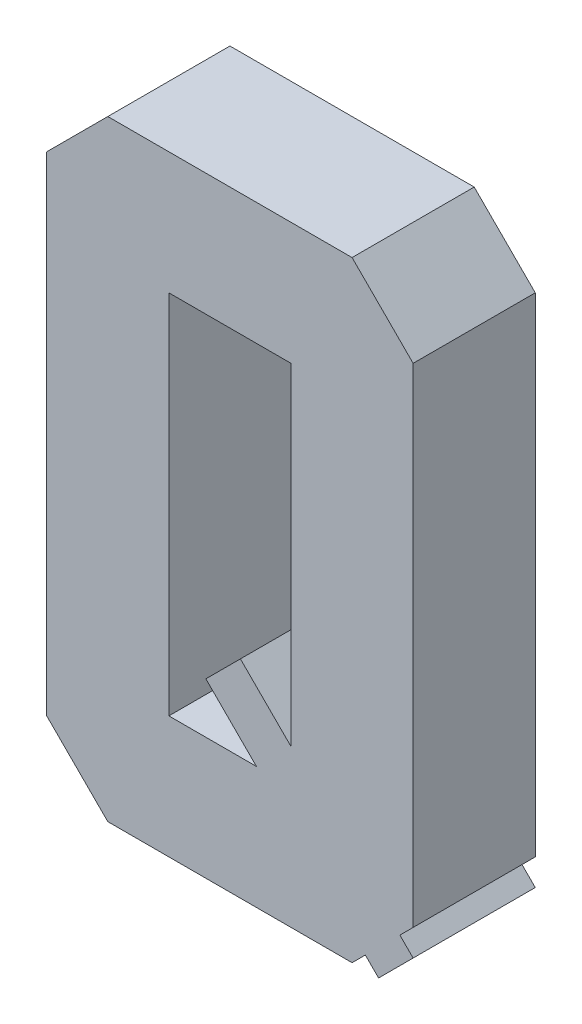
ISO-10303-21;
HEADER;
FILE_DESCRIPTION(('STEP AP214'),'2;1');
FILE_NAME('part.step','',(''),(''),'','','');
FILE_SCHEMA(('AUTOMOTIVE_DESIGN { 1 0 10303 214 1 1 1 1 }'));
ENDSEC;
DATA;
#1=APPLICATION_CONTEXT('core data for automotive mechanical design processes');
#2=APPLICATION_PROTOCOL_DEFINITION('international standard','automotive_design',2000,#1);
#3=PRODUCT_CONTEXT('',#1,'mechanical');
#4=PRODUCT('Part','Part','',(#3));
#5=PRODUCT_RELATED_PRODUCT_CATEGORY('part','',(#4));
#6=PRODUCT_DEFINITION_FORMATION('','',#4);
#7=PRODUCT_DEFINITION_CONTEXT('part definition',#1,'design');
#8=PRODUCT_DEFINITION('design','',#6,#7);
#9=PRODUCT_DEFINITION_SHAPE('','',#8);
#10=(LENGTH_UNIT() NAMED_UNIT(*) SI_UNIT(.MILLI.,.METRE.));
#11=(NAMED_UNIT(*) PLANE_ANGLE_UNIT() SI_UNIT($,.RADIAN.));
#12=(NAMED_UNIT(*) SI_UNIT($,.STERADIAN.) SOLID_ANGLE_UNIT());
#13=UNCERTAINTY_MEASURE_WITH_UNIT(LENGTH_MEASURE(1.E-05),#10,'distance_accuracy_value','');
#14=(GEOMETRIC_REPRESENTATION_CONTEXT(3) GLOBAL_UNCERTAINTY_ASSIGNED_CONTEXT((#13)) GLOBAL_UNIT_ASSIGNED_CONTEXT((#10,
#11,#12)) REPRESENTATION_CONTEXT('',''));
#15=CARTESIAN_POINT('',(0.,0.,0.));
#16=DIRECTION('',(0.,0.,1.));
#17=DIRECTION('',(1.,0.,0.));
#18=AXIS2_PLACEMENT_3D('',#15,#16,#17);
#19=CARTESIAN_POINT('',(30.,5.,10.));
#20=DIRECTION('',(-0.707106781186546,0.707106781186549,0.));
#21=DIRECTION('',(0.,0.,-1.));
#22=AXIS2_PLACEMENT_3D('',#19,#20,#21);
#23=PLANE('',#22);
#24=DIRECTION('',(0.,0.,1.));
#25=VECTOR('',#24,1.);
#26=CARTESIAN_POINT('',(26.0857864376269,1.08578643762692,10.));
#27=LINE('',#26,#25);
#28=CARTESIAN_POINT('',(26.0857864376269,1.08578643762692,10.));
#29=VERTEX_POINT('',#28);
#30=CARTESIAN_POINT('',(26.0857864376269,1.08578643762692,0.));
#31=VERTEX_POINT('',#30);
#32=EDGE_CURVE('E11',#29,#31,#27,.F.);
#33=ORIENTED_EDGE('',*,*,#32,.F.);
#34=DIRECTION('',(-0.707106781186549,-0.707106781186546,0.));
#35=VECTOR('',#34,1.);
#36=CARTESIAN_POINT('',(30.,5.,10.));
#37=LINE('',#36,#35);
#38=CARTESIAN_POINT('',(25.,0.,10.));
#39=VERTEX_POINT('',#38);
#40=EDGE_CURVE('E288',#39,#29,#37,.F.);
#41=ORIENTED_EDGE('',*,*,#40,.F.);
#42=DIRECTION('',(0.,0.,1.));
#43=VECTOR('',#42,1.);
#44=CARTESIAN_POINT('',(25.,0.,10.));
#45=LINE('',#44,#43);
#46=CARTESIAN_POINT('',(25.,0.,0.));
#47=VERTEX_POINT('',#46);
#48=EDGE_CURVE('E254',#47,#39,#45,.T.);
#49=ORIENTED_EDGE('',*,*,#48,.F.);
#50=DIRECTION('',(0.707106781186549,0.707106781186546,0.));
#51=VECTOR('',#50,1.);
#52=CARTESIAN_POINT('',(12.4999999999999,-12.5,0.));
#53=LINE('',#52,#51);
#54=EDGE_CURVE('E273',#31,#47,#53,.F.);
#55=ORIENTED_EDGE('',*,*,#54,.F.);
#56=EDGE_LOOP('',(#33,#41,#49,#55));
#57=FACE_BOUND('',#56,.T.);
#58=ADVANCED_FACE('F33',(#57),#23,.F.);
#59=CARTESIAN_POINT('',(0.,0.,10.));
#60=DIRECTION('',(0.,0.,-1.));
#61=DIRECTION('',(-1.,0.,0.));
#62=AXIS2_PLACEMENT_3D('',#59,#60,#61);
#63=PLANE('',#62);
#64=DIRECTION('',(0.707106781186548,-0.707106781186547,0.));
#65=VECTOR('',#64,1.);
#66=CARTESIAN_POINT('',(27.1715728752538,0.,10.));
#67=LINE('',#66,#65);
#68=CARTESIAN_POINT('',(13.0294372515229,14.1421356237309,10.));
#69=VERTEX_POINT('',#68);
#70=CARTESIAN_POINT('',(17.1715728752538,10.,10.));
#71=VERTEX_POINT('',#70);
#72=EDGE_CURVE('E194',#69,#71,#67,.T.);
#73=ORIENTED_EDGE('',*,*,#72,.T.);
#74=DIRECTION('',(1.,0.,0.));
#75=VECTOR('',#74,1.);
#76=CARTESIAN_POINT('',(10.,10.,10.));
#77=LINE('',#76,#75);
#78=CARTESIAN_POINT('',(10.,10.,10.));
#79=VERTEX_POINT('',#78);
#80=EDGE_CURVE('E48',#79,#71,#77,.T.);
#81=ORIENTED_EDGE('',*,*,#80,.F.);
#82=DIRECTION('',(0.,-1.,0.));
#83=VECTOR('',#82,1.);
#84=CARTESIAN_POINT('',(10.,40.,10.));
#85=LINE('',#84,#83);
#86=CARTESIAN_POINT('',(10.,40.,10.));
#87=VERTEX_POINT('',#86);
#88=EDGE_CURVE('E215',#87,#79,#85,.T.);
#89=ORIENTED_EDGE('',*,*,#88,.F.);
#90=DIRECTION('',(-1.,0.,0.));
#91=VECTOR('',#90,1.);
#92=CARTESIAN_POINT('',(10.,40.,10.));
#93=LINE('',#92,#91);
#94=CARTESIAN_POINT('',(20.,40.,10.));
#95=VERTEX_POINT('',#94);
#96=EDGE_CURVE('E221',#95,#87,#93,.T.);
#97=ORIENTED_EDGE('',*,*,#96,.F.);
#98=DIRECTION('',(0.,1.,0.));
#99=VECTOR('',#98,1.);
#100=CARTESIAN_POINT('',(20.,40.,10.));
#101=LINE('',#100,#99);
#102=CARTESIAN_POINT('',(20.,12.8284271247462,10.));
#103=VERTEX_POINT('',#102);
#104=EDGE_CURVE('E219',#103,#95,#101,.T.);
#105=ORIENTED_EDGE('',*,*,#104,.F.);
#106=DIRECTION('',(-0.707106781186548,0.707106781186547,0.));
#107=VECTOR('',#106,1.);
#108=CARTESIAN_POINT('',(30.,2.8284271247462,10.));
#109=LINE('',#108,#107);
#110=CARTESIAN_POINT('',(15.8578643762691,16.9705627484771,10.));
#111=VERTEX_POINT('',#110);
#112=EDGE_CURVE('E199',#103,#111,#109,.T.);
#113=ORIENTED_EDGE('',*,*,#112,.T.);
#114=DIRECTION('',(-0.707106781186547,-0.707106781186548,0.));
#115=VECTOR('',#114,1.);
#116=CARTESIAN_POINT('',(13.0294372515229,14.1421356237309,10.));
#117=LINE('',#116,#115);
#118=EDGE_CURVE('E172',#111,#69,#117,.T.);
#119=ORIENTED_EDGE('',*,*,#118,.T.);
#120=EDGE_LOOP('',(#73,#81,#89,#97,#105,#113,#119));
#121=FACE_BOUND('',#120,.T.);
#122=ORIENTED_EDGE('',*,*,#40,.T.);
#123=CARTESIAN_POINT('',(27.1715728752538,0.,10.));
#124=VERTEX_POINT('',#123);
#125=EDGE_CURVE('E197',#29,#124,#67,.T.);
#126=ORIENTED_EDGE('',*,*,#125,.T.);
#127=DIRECTION('',(0.707106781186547,0.707106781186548,0.));
#128=VECTOR('',#127,1.);
#129=CARTESIAN_POINT('',(27.1715728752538,0.,10.));
#130=LINE('',#129,#128);
#131=CARTESIAN_POINT('',(30.,2.8284271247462,10.));
#132=VERTEX_POINT('',#131);
#133=EDGE_CURVE('E179',#124,#132,#130,.T.);
#134=ORIENTED_EDGE('',*,*,#133,.T.);
#135=CARTESIAN_POINT('',(28.9142135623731,3.9142135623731,10.));
#136=VERTEX_POINT('',#135);
#137=EDGE_CURVE('E200',#132,#136,#109,.T.);
#138=ORIENTED_EDGE('',*,*,#137,.T.);
#139=CARTESIAN_POINT('',(30.,5.,10.));
#140=VERTEX_POINT('',#139);
#141=EDGE_CURVE('E287',#136,#140,#37,.F.);
#142=ORIENTED_EDGE('',*,*,#141,.T.);
#143=DIRECTION('',(0.,1.,0.));
#144=VECTOR('',#143,1.);
#145=CARTESIAN_POINT('',(30.,0.,10.));
#146=LINE('',#145,#144);
#147=CARTESIAN_POINT('',(30.,45.,10.));
#148=VERTEX_POINT('',#147);
#149=EDGE_CURVE('E248',#140,#148,#146,.T.);
#150=ORIENTED_EDGE('',*,*,#149,.T.);
#151=DIRECTION('',(0.707106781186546,-0.707106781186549,0.));
#152=VECTOR('',#151,1.);
#153=CARTESIAN_POINT('',(25.,50.,10.));
#154=LINE('',#153,#152);
#155=CARTESIAN_POINT('',(25.,50.,10.));
#156=VERTEX_POINT('',#155);
#157=EDGE_CURVE('E285',#148,#156,#154,.F.);
#158=ORIENTED_EDGE('',*,*,#157,.T.);
#159=DIRECTION('',(-1.,0.,0.));
#160=VECTOR('',#159,1.);
#161=CARTESIAN_POINT('',(0.,50.,10.));
#162=LINE('',#161,#160);
#163=CARTESIAN_POINT('',(5.00000000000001,50.,10.));
#164=VERTEX_POINT('',#163);
#165=EDGE_CURVE('E251',#156,#164,#162,.T.);
#166=ORIENTED_EDGE('',*,*,#165,.T.);
#167=DIRECTION('',(0.707106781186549,0.707106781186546,0.));
#168=VECTOR('',#167,1.);
#169=CARTESIAN_POINT('',(0.,45.,10.));
#170=LINE('',#169,#168);
#171=CARTESIAN_POINT('',(0.,45.,10.));
#172=VERTEX_POINT('',#171);
#173=EDGE_CURVE('E283',#164,#172,#170,.F.);
#174=ORIENTED_EDGE('',*,*,#173,.T.);
#175=DIRECTION('',(0.,-1.,0.));
#176=VECTOR('',#175,1.);
#177=CARTESIAN_POINT('',(0.,0.,10.));
#178=LINE('',#177,#176);
#179=CARTESIAN_POINT('',(0.,5.00000000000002,10.));
#180=VERTEX_POINT('',#179);
#181=EDGE_CURVE('E241',#172,#180,#178,.T.);
#182=ORIENTED_EDGE('',*,*,#181,.T.);
#183=DIRECTION('',(-0.707106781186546,0.707106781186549,0.));
#184=VECTOR('',#183,1.);
#185=CARTESIAN_POINT('',(5.,0.,10.));
#186=LINE('',#185,#184);
#187=CARTESIAN_POINT('',(5.,0.,10.));
#188=VERTEX_POINT('',#187);
#189=EDGE_CURVE('E291',#180,#188,#186,.F.);
#190=ORIENTED_EDGE('',*,*,#189,.T.);
#191=DIRECTION('',(1.,0.,0.));
#192=VECTOR('',#191,1.);
#193=CARTESIAN_POINT('',(0.,0.,10.));
#194=LINE('',#193,#192);
#195=EDGE_CURVE('E244',#188,#39,#194,.T.);
#196=ORIENTED_EDGE('',*,*,#195,.T.);
#197=EDGE_LOOP('',(#122,#126,#134,#138,#142,#150,#158,#166,#174,#182,#190,#196));
#198=FACE_BOUND('',#197,.T.);
#199=ADVANCED_FACE('F313',(#121,#198),#63,.F.);
#200=CARTESIAN_POINT('',(0.,0.,0.));
#201=DIRECTION('',(0.,0.,-1.));
#202=DIRECTION('',(-1.,0.,0.));
#203=AXIS2_PLACEMENT_3D('',#200,#201,#202);
#204=PLANE('',#203);
#205=DIRECTION('',(1.,0.,0.));
#206=VECTOR('',#205,1.);
#207=CARTESIAN_POINT('',(10.,10.,0.));
#208=LINE('',#207,#206);
#209=CARTESIAN_POINT('',(10.,10.,0.));
#210=VERTEX_POINT('',#209);
#211=CARTESIAN_POINT('',(17.1715728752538,10.,0.));
#212=VERTEX_POINT('',#211);
#213=EDGE_CURVE('E226',#210,#212,#208,.T.);
#214=ORIENTED_EDGE('',*,*,#213,.T.);
#215=DIRECTION('',(0.707106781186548,-0.707106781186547,0.));
#216=VECTOR('',#215,1.);
#217=CARTESIAN_POINT('',(27.1715728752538,0.,0.));
#218=LINE('',#217,#216);
#219=CARTESIAN_POINT('',(13.0294372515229,14.1421356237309,0.));
#220=VERTEX_POINT('',#219);
#221=EDGE_CURVE('E171',#220,#212,#218,.T.);
#222=ORIENTED_EDGE('',*,*,#221,.F.);
#223=DIRECTION('',(-0.707106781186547,-0.707106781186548,0.));
#224=VECTOR('',#223,1.);
#225=CARTESIAN_POINT('',(13.0294372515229,14.1421356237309,0.));
#226=LINE('',#225,#224);
#227=CARTESIAN_POINT('',(15.8578643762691,16.9705627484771,0.));
#228=VERTEX_POINT('',#227);
#229=EDGE_CURVE('E181',#228,#220,#226,.T.);
#230=ORIENTED_EDGE('',*,*,#229,.F.);
#231=DIRECTION('',(-0.707106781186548,0.707106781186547,0.));
#232=VECTOR('',#231,1.);
#233=CARTESIAN_POINT('',(30.,2.8284271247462,0.));
#234=LINE('',#233,#232);
#235=CARTESIAN_POINT('',(20.,12.8284271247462,0.));
#236=VERTEX_POINT('',#235);
#237=EDGE_CURVE('E187',#236,#228,#234,.T.);
#238=ORIENTED_EDGE('',*,*,#237,.F.);
#239=DIRECTION('',(0.,1.,0.));
#240=VECTOR('',#239,1.);
#241=CARTESIAN_POINT('',(20.,40.,0.));
#242=LINE('',#241,#240);
#243=CARTESIAN_POINT('',(20.,40.,0.));
#244=VERTEX_POINT('',#243);
#245=EDGE_CURVE('E228',#236,#244,#242,.T.);
#246=ORIENTED_EDGE('',*,*,#245,.T.);
#247=DIRECTION('',(-1.,0.,0.));
#248=VECTOR('',#247,1.);
#249=CARTESIAN_POINT('',(10.,40.,0.));
#250=LINE('',#249,#248);
#251=CARTESIAN_POINT('',(10.,40.,0.));
#252=VERTEX_POINT('',#251);
#253=EDGE_CURVE('E217',#244,#252,#250,.T.);
#254=ORIENTED_EDGE('',*,*,#253,.T.);
#255=DIRECTION('',(0.,-1.,0.));
#256=VECTOR('',#255,1.);
#257=CARTESIAN_POINT('',(10.,40.,0.));
#258=LINE('',#257,#256);
#259=EDGE_CURVE('E214',#252,#210,#258,.T.);
#260=ORIENTED_EDGE('',*,*,#259,.T.);
#261=EDGE_LOOP('',(#214,#222,#230,#238,#246,#254,#260));
#262=FACE_BOUND('',#261,.T.);
#263=CARTESIAN_POINT('',(27.1715728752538,0.,0.));
#264=VERTEX_POINT('',#263);
#265=EDGE_CURVE('E162',#31,#264,#218,.T.);
#266=ORIENTED_EDGE('',*,*,#265,.F.);
#267=ORIENTED_EDGE('',*,*,#54,.T.);
#268=DIRECTION('',(1.,0.,0.));
#269=VECTOR('',#268,1.);
#270=CARTESIAN_POINT('',(0.,0.,0.));
#271=LINE('',#270,#269);
#272=CARTESIAN_POINT('',(5.,0.,0.));
#273=VERTEX_POINT('',#272);
#274=EDGE_CURVE('E257',#273,#47,#271,.T.);
#275=ORIENTED_EDGE('',*,*,#274,.F.);
#276=DIRECTION('',(0.707106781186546,-0.707106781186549,0.));
#277=VECTOR('',#276,1.);
#278=CARTESIAN_POINT('',(2.50000000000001,2.5,0.));
#279=LINE('',#278,#277);
#280=CARTESIAN_POINT('',(0.,5.00000000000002,0.));
#281=VERTEX_POINT('',#280);
#282=EDGE_CURVE('E276',#273,#281,#279,.F.);
#283=ORIENTED_EDGE('',*,*,#282,.T.);
#284=DIRECTION('',(0.,-1.,0.));
#285=VECTOR('',#284,1.);
#286=CARTESIAN_POINT('',(0.,0.,0.));
#287=LINE('',#286,#285);
#288=CARTESIAN_POINT('',(0.,45.,0.));
#289=VERTEX_POINT('',#288);
#290=EDGE_CURVE('E240',#289,#281,#287,.T.);
#291=ORIENTED_EDGE('',*,*,#290,.F.);
#292=DIRECTION('',(-0.707106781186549,-0.707106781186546,0.));
#293=VECTOR('',#292,1.);
#294=CARTESIAN_POINT('',(-22.5,22.5000000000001,0.));
#295=LINE('',#294,#293);
#296=CARTESIAN_POINT('',(5.00000000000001,50.,0.));
#297=VERTEX_POINT('',#296);
#298=EDGE_CURVE('E269',#289,#297,#295,.F.);
#299=ORIENTED_EDGE('',*,*,#298,.T.);
#300=DIRECTION('',(-1.,0.,0.));
#301=VECTOR('',#300,1.);
#302=CARTESIAN_POINT('',(0.,50.,0.));
#303=LINE('',#302,#301);
#304=CARTESIAN_POINT('',(25.,50.,0.));
#305=VERTEX_POINT('',#304);
#306=EDGE_CURVE('E245',#305,#297,#303,.T.);
#307=ORIENTED_EDGE('',*,*,#306,.F.);
#308=DIRECTION('',(-0.707106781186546,0.707106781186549,0.));
#309=VECTOR('',#308,1.);
#310=CARTESIAN_POINT('',(37.5,37.4999999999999,0.));
#311=LINE('',#310,#309);
#312=CARTESIAN_POINT('',(30.,45.,0.));
#313=VERTEX_POINT('',#312);
#314=EDGE_CURVE('E271',#305,#313,#311,.F.);
#315=ORIENTED_EDGE('',*,*,#314,.T.);
#316=DIRECTION('',(0.,1.,0.));
#317=VECTOR('',#316,1.);
#318=CARTESIAN_POINT('',(30.,0.,0.));
#319=LINE('',#318,#317);
#320=CARTESIAN_POINT('',(30.,5.,0.));
#321=VERTEX_POINT('',#320);
#322=EDGE_CURVE('E260',#321,#313,#319,.T.);
#323=ORIENTED_EDGE('',*,*,#322,.F.);
#324=CARTESIAN_POINT('',(28.9142135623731,3.9142135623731,0.));
#325=VERTEX_POINT('',#324);
#326=EDGE_CURVE('E274',#321,#325,#53,.F.);
#327=ORIENTED_EDGE('',*,*,#326,.T.);
#328=CARTESIAN_POINT('',(30.,2.8284271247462,0.));
#329=VERTEX_POINT('',#328);
#330=EDGE_CURVE('E186',#329,#325,#234,.T.);
#331=ORIENTED_EDGE('',*,*,#330,.F.);
#332=DIRECTION('',(0.707106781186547,0.707106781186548,0.));
#333=VECTOR('',#332,1.);
#334=CARTESIAN_POINT('',(27.1715728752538,0.,0.));
#335=LINE('',#334,#333);
#336=EDGE_CURVE('E177',#264,#329,#335,.T.);
#337=ORIENTED_EDGE('',*,*,#336,.F.);
#338=EDGE_LOOP('',(#266,#267,#275,#283,#291,#299,#307,#315,#323,#327,#331,#337));
#339=FACE_BOUND('',#338,.T.);
#340=ADVANCED_FACE('F184',(#262,#339),#204,.T.);
#341=CARTESIAN_POINT('',(0.,0.,10.));
#342=DIRECTION('',(1.,0.,0.));
#343=DIRECTION('',(0.,0.,-1.));
#344=AXIS2_PLACEMENT_3D('',#341,#342,#343);
#345=PLANE('',#344);
#346=ORIENTED_EDGE('',*,*,#290,.T.);
#347=DIRECTION('',(0.,0.,1.));
#348=VECTOR('',#347,1.);
#349=CARTESIAN_POINT('',(0.,5.00000000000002,10.));
#350=LINE('',#349,#348);
#351=EDGE_CURVE('E281',#281,#180,#350,.T.);
#352=ORIENTED_EDGE('',*,*,#351,.T.);
#353=ORIENTED_EDGE('',*,*,#181,.F.);
#354=DIRECTION('',(0.,0.,-1.));
#355=VECTOR('',#354,1.);
#356=CARTESIAN_POINT('',(0.,45.,10.));
#357=LINE('',#356,#355);
#358=EDGE_CURVE('E278',#172,#289,#357,.T.);
#359=ORIENTED_EDGE('',*,*,#358,.T.);
#360=EDGE_LOOP('',(#346,#352,#353,#359));
#361=FACE_BOUND('',#360,.T.);
#362=ADVANCED_FACE('F333',(#361),#345,.F.);
#363=CARTESIAN_POINT('',(0.,0.,10.));
#364=DIRECTION('',(0.,1.,0.));
#365=DIRECTION('',(0.,0.,1.));
#366=AXIS2_PLACEMENT_3D('',#363,#364,#365);
#367=PLANE('',#366);
#368=ORIENTED_EDGE('',*,*,#195,.F.);
#369=DIRECTION('',(0.,0.,-1.));
#370=VECTOR('',#369,1.);
#371=CARTESIAN_POINT('',(5.,0.,10.));
#372=LINE('',#371,#370);
#373=EDGE_CURVE('E266',#188,#273,#372,.T.);
#374=ORIENTED_EDGE('',*,*,#373,.T.);
#375=ORIENTED_EDGE('',*,*,#274,.T.);
#376=ORIENTED_EDGE('',*,*,#48,.T.);
#377=EDGE_LOOP('',(#368,#374,#375,#376));
#378=FACE_BOUND('',#377,.T.);
#379=ADVANCED_FACE('F342',(#378),#367,.F.);
#380=CARTESIAN_POINT('',(30.,0.,10.));
#381=DIRECTION('',(-1.,0.,0.));
#382=DIRECTION('',(0.,0.,1.));
#383=AXIS2_PLACEMENT_3D('',#380,#381,#382);
#384=PLANE('',#383);
#385=ORIENTED_EDGE('',*,*,#149,.F.);
#386=DIRECTION('',(0.,0.,-1.));
#387=VECTOR('',#386,1.);
#388=CARTESIAN_POINT('',(30.,5.,10.));
#389=LINE('',#388,#387);
#390=EDGE_CURVE('E295',#140,#321,#389,.T.);
#391=ORIENTED_EDGE('',*,*,#390,.T.);
#392=ORIENTED_EDGE('',*,*,#322,.T.);
#393=DIRECTION('',(0.,0.,1.));
#394=VECTOR('',#393,1.);
#395=CARTESIAN_POINT('',(30.,45.,10.));
#396=LINE('',#395,#394);
#397=EDGE_CURVE('E293',#313,#148,#396,.T.);
#398=ORIENTED_EDGE('',*,*,#397,.T.);
#399=EDGE_LOOP('',(#385,#391,#392,#398));
#400=FACE_BOUND('',#399,.T.);
#401=ADVANCED_FACE('F316',(#400),#384,.F.);
#402=CARTESIAN_POINT('',(0.,50.,10.));
#403=DIRECTION('',(0.,-1.,0.));
#404=DIRECTION('',(0.,0.,-1.));
#405=AXIS2_PLACEMENT_3D('',#402,#403,#404);
#406=PLANE('',#405);
#407=ORIENTED_EDGE('',*,*,#165,.F.);
#408=DIRECTION('',(0.,0.,-1.));
#409=VECTOR('',#408,1.);
#410=CARTESIAN_POINT('',(25.,50.,10.));
#411=LINE('',#410,#409);
#412=EDGE_CURVE('E300',#156,#305,#411,.T.);
#413=ORIENTED_EDGE('',*,*,#412,.T.);
#414=ORIENTED_EDGE('',*,*,#306,.T.);
#415=DIRECTION('',(0.,0.,1.));
#416=VECTOR('',#415,1.);
#417=CARTESIAN_POINT('',(5.00000000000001,50.,10.));
#418=LINE('',#417,#416);
#419=EDGE_CURVE('E298',#297,#164,#418,.T.);
#420=ORIENTED_EDGE('',*,*,#419,.T.);
#421=EDGE_LOOP('',(#407,#413,#414,#420));
#422=FACE_BOUND('',#421,.T.);
#423=ADVANCED_FACE('F325',(#422),#406,.F.);
#424=CARTESIAN_POINT('',(10.,40.,10.));
#425=DIRECTION('',(1.,0.,0.));
#426=DIRECTION('',(0.,1.,0.));
#427=AXIS2_PLACEMENT_3D('',#424,#425,#426);
#428=PLANE('',#427);
#429=ORIENTED_EDGE('',*,*,#259,.F.);
#430=DIRECTION('',(0.,0.,-1.));
#431=VECTOR('',#430,1.);
#432=CARTESIAN_POINT('',(10.,40.,10.));
#433=LINE('',#432,#431);
#434=EDGE_CURVE('E223',#87,#252,#433,.T.);
#435=ORIENTED_EDGE('',*,*,#434,.F.);
#436=ORIENTED_EDGE('',*,*,#88,.T.);
#437=DIRECTION('',(0.,0.,-1.));
#438=VECTOR('',#437,1.);
#439=CARTESIAN_POINT('',(10.,10.,10.));
#440=LINE('',#439,#438);
#441=EDGE_CURVE('E237',#79,#210,#440,.T.);
#442=ORIENTED_EDGE('',*,*,#441,.T.);
#443=EDGE_LOOP('',(#429,#435,#436,#442));
#444=FACE_BOUND('',#443,.T.);
#445=ADVANCED_FACE('F375',(#444),#428,.T.);
#446=CARTESIAN_POINT('',(10.,10.,10.));
#447=DIRECTION('',(0.,1.,0.));
#448=DIRECTION('',(0.,0.,1.));
#449=AXIS2_PLACEMENT_3D('',#446,#447,#448);
#450=PLANE('',#449);
#451=DIRECTION('',(0.,0.,1.));
#452=VECTOR('',#451,1.);
#453=CARTESIAN_POINT('',(17.1715728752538,10.,10.));
#454=LINE('',#453,#452);
#455=EDGE_CURVE('E52',#212,#71,#454,.T.);
#456=ORIENTED_EDGE('',*,*,#455,.F.);
#457=ORIENTED_EDGE('',*,*,#213,.F.);
#458=ORIENTED_EDGE('',*,*,#441,.F.);
#459=ORIENTED_EDGE('',*,*,#80,.T.);
#460=EDGE_LOOP('',(#456,#457,#458,#459));
#461=FACE_BOUND('',#460,.T.);
#462=ADVANCED_FACE('F381',(#461),#450,.T.);
#463=CARTESIAN_POINT('',(20.,40.,10.));
#464=DIRECTION('',(-1.,0.,0.));
#465=DIRECTION('',(0.,-1.,0.));
#466=AXIS2_PLACEMENT_3D('',#463,#464,#465);
#467=PLANE('',#466);
#468=DIRECTION('',(0.,0.,-1.));
#469=VECTOR('',#468,1.);
#470=CARTESIAN_POINT('',(20.,12.8284271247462,10.));
#471=LINE('',#470,#469);
#472=EDGE_CURVE('E206',#103,#236,#471,.T.);
#473=ORIENTED_EDGE('',*,*,#472,.F.);
#474=ORIENTED_EDGE('',*,*,#104,.T.);
#475=DIRECTION('',(0.,0.,-1.));
#476=VECTOR('',#475,1.);
#477=CARTESIAN_POINT('',(20.,40.,10.));
#478=LINE('',#477,#476);
#479=EDGE_CURVE('E234',#95,#244,#478,.T.);
#480=ORIENTED_EDGE('',*,*,#479,.T.);
#481=ORIENTED_EDGE('',*,*,#245,.F.);
#482=EDGE_LOOP('',(#473,#474,#480,#481));
#483=FACE_BOUND('',#482,.T.);
#484=ADVANCED_FACE('F363',(#483),#467,.T.);
#485=CARTESIAN_POINT('',(10.,40.,10.));
#486=DIRECTION('',(0.,-1.,0.));
#487=DIRECTION('',(0.,0.,-1.));
#488=AXIS2_PLACEMENT_3D('',#485,#486,#487);
#489=PLANE('',#488);
#490=ORIENTED_EDGE('',*,*,#253,.F.);
#491=ORIENTED_EDGE('',*,*,#479,.F.);
#492=ORIENTED_EDGE('',*,*,#96,.T.);
#493=ORIENTED_EDGE('',*,*,#434,.T.);
#494=EDGE_LOOP('',(#490,#491,#492,#493));
#495=FACE_BOUND('',#494,.T.);
#496=ADVANCED_FACE('F359',(#495),#489,.T.);
#497=CARTESIAN_POINT('',(5.,0.,10.));
#498=DIRECTION('',(0.707106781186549,0.707106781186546,0.));
#499=DIRECTION('',(0.,0.,-1.));
#500=AXIS2_PLACEMENT_3D('',#497,#498,#499);
#501=PLANE('',#500);
#502=ORIENTED_EDGE('',*,*,#189,.F.);
#503=ORIENTED_EDGE('',*,*,#351,.F.);
#504=ORIENTED_EDGE('',*,*,#282,.F.);
#505=ORIENTED_EDGE('',*,*,#373,.F.);
#506=EDGE_LOOP('',(#502,#503,#504,#505));
#507=FACE_BOUND('',#506,.T.);
#508=ADVANCED_FACE('F337',(#507),#501,.F.);
#509=DIRECTION('',(0.,0.,-1.));
#510=VECTOR('',#509,1.);
#511=CARTESIAN_POINT('',(28.9142135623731,3.91421356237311,10.));
#512=LINE('',#511,#510);
#513=EDGE_CURVE('E41',#325,#136,#512,.F.);
#514=ORIENTED_EDGE('',*,*,#513,.F.);
#515=ORIENTED_EDGE('',*,*,#326,.F.);
#516=ORIENTED_EDGE('',*,*,#390,.F.);
#517=ORIENTED_EDGE('',*,*,#141,.F.);
#518=EDGE_LOOP('',(#514,#515,#516,#517));
#519=FACE_BOUND('',#518,.T.);
#520=ADVANCED_FACE('F310',(#519),#23,.F.);
#521=CARTESIAN_POINT('',(25.,50.,10.));
#522=DIRECTION('',(-0.707106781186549,-0.707106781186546,0.));
#523=DIRECTION('',(0.,0.,-1.));
#524=AXIS2_PLACEMENT_3D('',#521,#522,#523);
#525=PLANE('',#524);
#526=ORIENTED_EDGE('',*,*,#157,.F.);
#527=ORIENTED_EDGE('',*,*,#397,.F.);
#528=ORIENTED_EDGE('',*,*,#314,.F.);
#529=ORIENTED_EDGE('',*,*,#412,.F.);
#530=EDGE_LOOP('',(#526,#527,#528,#529));
#531=FACE_BOUND('',#530,.T.);
#532=ADVANCED_FACE('F320',(#531),#525,.F.);
#533=CARTESIAN_POINT('',(0.,45.,10.));
#534=DIRECTION('',(0.707106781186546,-0.707106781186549,0.));
#535=DIRECTION('',(0.,0.,-1.));
#536=AXIS2_PLACEMENT_3D('',#533,#534,#535);
#537=PLANE('',#536);
#538=ORIENTED_EDGE('',*,*,#173,.F.);
#539=ORIENTED_EDGE('',*,*,#419,.F.);
#540=ORIENTED_EDGE('',*,*,#298,.F.);
#541=ORIENTED_EDGE('',*,*,#358,.F.);
#542=EDGE_LOOP('',(#538,#539,#540,#541));
#543=FACE_BOUND('',#542,.T.);
#544=ADVANCED_FACE('F35',(#543),#537,.F.);
#545=CARTESIAN_POINT('',(27.1715728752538,0.,0.));
#546=DIRECTION('',(0.707106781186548,-0.707106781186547,0.));
#547=DIRECTION('',(0.707106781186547,0.707106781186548,0.));
#548=AXIS2_PLACEMENT_3D('',#545,#546,#547);
#549=PLANE('',#548);
#550=ORIENTED_EDGE('',*,*,#133,.F.);
#551=DIRECTION('',(0.,0.,1.));
#552=VECTOR('',#551,1.);
#553=CARTESIAN_POINT('',(27.1715728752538,0.,0.));
#554=LINE('',#553,#552);
#555=EDGE_CURVE('E165',#264,#124,#554,.T.);
#556=ORIENTED_EDGE('',*,*,#555,.F.);
#557=ORIENTED_EDGE('',*,*,#336,.T.);
#558=DIRECTION('',(0.,0.,1.));
#559=VECTOR('',#558,1.);
#560=CARTESIAN_POINT('',(30.,2.8284271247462,0.));
#561=LINE('',#560,#559);
#562=EDGE_CURVE('E180',#329,#132,#561,.T.);
#563=ORIENTED_EDGE('',*,*,#562,.T.);
#564=EDGE_LOOP('',(#550,#556,#557,#563));
#565=FACE_BOUND('',#564,.T.);
#566=ADVANCED_FACE('F176',(#565),#549,.T.);
#567=CARTESIAN_POINT('',(30.,2.8284271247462,0.));
#568=DIRECTION('',(0.707106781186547,0.707106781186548,0.));
#569=DIRECTION('',(-0.707106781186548,0.707106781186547,0.));
#570=AXIS2_PLACEMENT_3D('',#567,#568,#569);
#571=PLANE('',#570);
#572=ORIENTED_EDGE('',*,*,#330,.T.);
#573=ORIENTED_EDGE('',*,*,#513,.T.);
#574=ORIENTED_EDGE('',*,*,#137,.F.);
#575=ORIENTED_EDGE('',*,*,#562,.F.);
#576=EDGE_LOOP('',(#572,#573,#574,#575));
#577=FACE_BOUND('',#576,.T.);
#578=ADVANCED_FACE('F307',(#577),#571,.T.);
#579=CARTESIAN_POINT('',(27.1715728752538,0.,0.));
#580=DIRECTION('',(-0.707106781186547,-0.707106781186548,0.));
#581=DIRECTION('',(0.707106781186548,-0.707106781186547,0.));
#582=AXIS2_PLACEMENT_3D('',#579,#580,#581);
#583=PLANE('',#582);
#584=ORIENTED_EDGE('',*,*,#125,.F.);
#585=ORIENTED_EDGE('',*,*,#32,.T.);
#586=ORIENTED_EDGE('',*,*,#265,.T.);
#587=ORIENTED_EDGE('',*,*,#555,.T.);
#588=EDGE_LOOP('',(#584,#585,#586,#587));
#589=FACE_BOUND('',#588,.T.);
#590=ADVANCED_FACE('F164',(#589),#583,.T.);
#591=ORIENTED_EDGE('',*,*,#221,.T.);
#592=ORIENTED_EDGE('',*,*,#455,.T.);
#593=ORIENTED_EDGE('',*,*,#72,.F.);
#594=DIRECTION('',(0.,0.,1.));
#595=VECTOR('',#594,1.);
#596=CARTESIAN_POINT('',(13.0294372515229,14.1421356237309,0.));
#597=LINE('',#596,#595);
#598=EDGE_CURVE('E204',#220,#69,#597,.T.);
#599=ORIENTED_EDGE('',*,*,#598,.F.);
#600=EDGE_LOOP('',(#591,#592,#593,#599));
#601=FACE_BOUND('',#600,.T.);
#602=ADVANCED_FACE('F390',(#601),#583,.T.);
#603=ORIENTED_EDGE('',*,*,#112,.F.);
#604=ORIENTED_EDGE('',*,*,#472,.T.);
#605=ORIENTED_EDGE('',*,*,#237,.T.);
#606=DIRECTION('',(0.,0.,1.));
#607=VECTOR('',#606,1.);
#608=CARTESIAN_POINT('',(15.8578643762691,16.9705627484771,0.));
#609=LINE('',#608,#607);
#610=EDGE_CURVE('E207',#228,#111,#609,.T.);
#611=ORIENTED_EDGE('',*,*,#610,.T.);
#612=EDGE_LOOP('',(#603,#604,#605,#611));
#613=FACE_BOUND('',#612,.T.);
#614=ADVANCED_FACE('F395',(#613),#571,.T.);
#615=CARTESIAN_POINT('',(13.0294372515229,14.1421356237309,0.));
#616=DIRECTION('',(-0.707106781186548,0.707106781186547,0.));
#617=DIRECTION('',(-0.707106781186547,-0.707106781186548,0.));
#618=AXIS2_PLACEMENT_3D('',#615,#616,#617);
#619=PLANE('',#618);
#620=ORIENTED_EDGE('',*,*,#118,.F.);
#621=ORIENTED_EDGE('',*,*,#610,.F.);
#622=ORIENTED_EDGE('',*,*,#229,.T.);
#623=ORIENTED_EDGE('',*,*,#598,.T.);
#624=EDGE_LOOP('',(#620,#621,#622,#623));
#625=FACE_BOUND('',#624,.T.);
#626=ADVANCED_FACE('F396',(#625),#619,.T.);
#627=CLOSED_SHELL('',(#58,#199,#340,#362,#379,#401,#423,#445,#462,#484,#496,#508,#520,#532,#544,
#566,#578,#590,#602,#614,#626));
#628=MANIFOLD_SOLID_BREP('B2',#627);
#629=ADVANCED_BREP_SHAPE_REPRESENTATION('',(#18,#628),#14);
#630=SHAPE_DEFINITION_REPRESENTATION(#9,#629);
ENDSEC;
END-ISO-10303-21;
